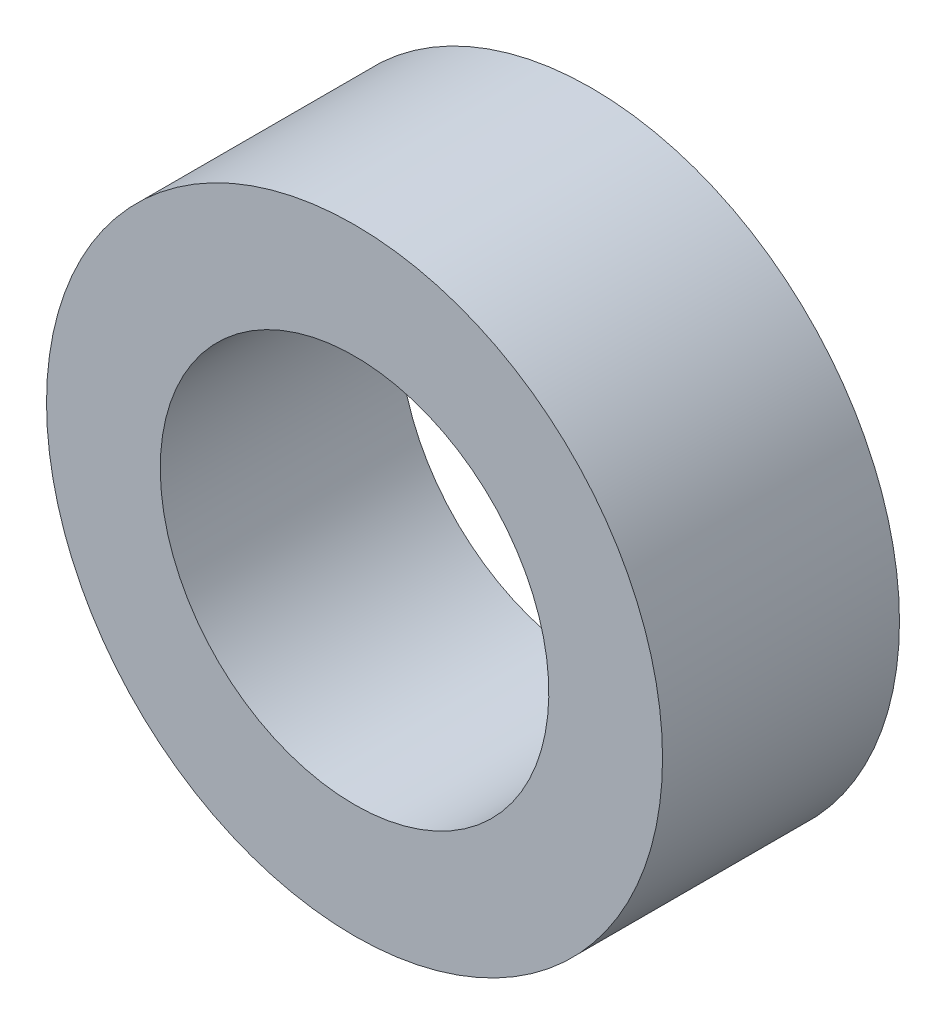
from build123d import *

# Parameters (mm, degrees)
SKETCH1_R           = 4.1
BOSS_EXTRUDE1_DEPTH = 5.05
BOSS_EXTRUDE2_START = -5
SKETCH4_R           = 6.5
SKETCH4_R_2         = 4.1
BOSS_EXTRUDE2_DEPTH = 5


with BuildPart() as part:
    # Sketch1 → Boss-Extrude1 (new body)
    with BuildSketch(Plane.XY):
        with BuildLine():
            ThreePointArc((-175.492813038, 540.062201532), (-176.844885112, 532.676178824), (-169.458862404, 531.32410675))
            ThreePointArc((-169.458862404, 531.32410675), (-168.106790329, 538.710129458), (-175.492813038, 540.062201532))
        make_face()
        with Locations(Location((-172.475837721, 535.693154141, 0), (0, 0, 270))):
            Circle(SKETCH1_R, mode=Mode.SUBTRACT)
    extrude(amount=BOSS_EXTRUDE1_DEPTH)

    # Sketch4 → Boss-Extrude2 (add)
    with BuildSketch(Plane.XY.offset(5.05).offset(BOSS_EXTRUDE2_START)):
        with Locations((-172.475837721, 535.693154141)):
            Circle(SKETCH4_R)
        with Locations(Location((-172.475837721, 535.693154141, 0), (0, 0, 270))):
            Circle(SKETCH4_R_2, mode=Mode.SUBTRACT)
    extrude(amount=BOSS_EXTRUDE2_DEPTH)


solid = part.part
